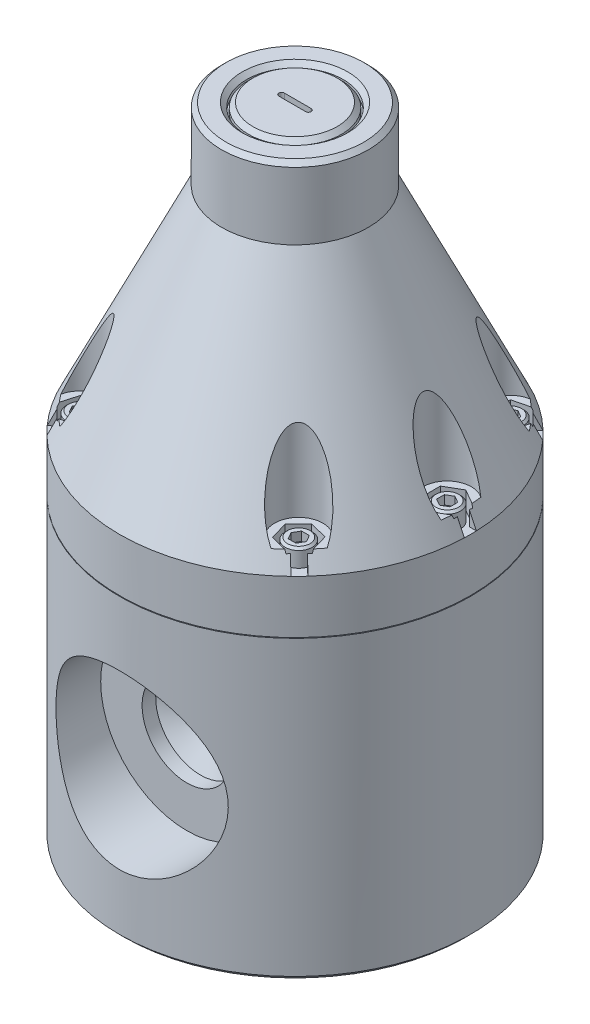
from build123d import *

# Parameters (mm, degrees)
SKETCH1_R                = 62.23
EXTRUDE1_DEPTH           = 226.06
SKETCH3_R                = 8.5725
EXTRUDE2_DEPTH           = 50.8
EXTRUDE3_DEPTH           = 6.223
SKETCH5_W                = 7.654715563
SKETCH5_H                = 4.2672
EXTRUDE4_DEPTH           = 6.223
SKETCH6_R                = 4.7625
EXTRUDE6_DEPTH           = 6.223
EXTRUDE7_DEPTH           = 3.175
CHAMFER1_SIZE            = 0.762
CHAMFER1_OF_MIRROR1_SIZE = 0.762
SKETCH8_R                = 17.145
EXTRUDE8_DEPTH           = 3.175
SKETCH9_R                = 16.51
EXTRUDE9_DEPTH           = 3.175
EXTRUDE10_DEPTH          = 3.175
CHAMFER2_SIZE            = 1.5748
CHAMFER3_SIZE            = 1.5748
CHAMFER4_SIZE            = 1.5748


with BuildPart() as part:
    # Sketch1 → Extrude1 (new body)
    with BuildSketch(Plane(origin=(0, 0, 0), x_dir=(1, 0, 0), z_dir=(0, 1, 0))):
        with Locations(Location((0, 0, 0), (0, 0, 90))):
            Circle(SKETCH1_R)
    extrude(amount=EXTRUDE1_DEPTH)

    # Sketch2 → Cut-Revolve1 (revolve, cut)
    with BuildSketch(Plane.XY, mode=Mode.PRIVATE) as cut_revolve1_sk:
        Polygon((-67.536130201, 105.41), (-45.085, 105.41), (-45.085, 105.664), (-62.23, 105.664), (-62.23, 124.46), (-26.035, 200.66), (-26.035, 228.6), (-77.461567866, 228.6), (-77.461567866, 105.41), align=None)
    revolve(cut_revolve1_sk.sketch.rotate(Axis((0, 0, 0), (0, 1, 0)), 180), axis=Axis((0, 0, 0), (0, 1, 0)), mode=Mode.SUBTRACT)

    # Sketch3 → Extrude2 (cut)
    with BuildSketch(Plane(origin=(0, 130.683, 0), x_dir=(-1, 0, 0), z_dir=(0, 1, 0))):
        with Locations((-38.826365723, 37.494185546)):
            Circle(SKETCH3_R)
        with Locations((-53.975, 0)):
            Circle(SKETCH3_R)
        with Locations((-38.826365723, -37.494185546)):
            Circle(SKETCH3_R)
    extrude2 = extrude(amount=EXTRUDE2_DEPTH, mode=Mode.SUBTRACT)

    # Sketch4 → Extrude3 (cut)
    with BuildSketch(Plane(origin=(0, 130.683, 0), x_dir=(-1, 0, 0), z_dir=(0, 1, 0))):
        Polygon((-43.410495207, 32.747180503), (-37.007403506, 31.150710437), (-32.423274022, 35.89771548), (-34.24223624, 42.241190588), (-40.64532794, 43.837660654), (-45.229457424, 39.090655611), align=None)
        Polygon((-53.975, 6.599113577), (-59.69, 3.299556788), (-59.69, -3.299556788), (-53.975, -6.599113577), (-48.26, -3.299556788), (-48.26, 3.299556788), align=None)
        Polygon((-43.410495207, -32.747180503), (-45.229457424, -39.090655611), (-40.64532794, -43.837660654), (-34.24223624, -42.241190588), (-32.423274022, -35.89771548), (-37.007403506, -31.150710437), align=None)
    extrude3 = extrude(amount=-EXTRUDE3_DEPTH, mode=Mode.SUBTRACT)

    # Sketch5 → Extrude4 (cut)
    with BuildSketch(Plane(origin=(0, 130.683, 0), x_dir=(-1, 0, 0), z_dir=(0, 1, 0))):
        Polygon((-39.947895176, 41.543286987), (-44.67273389, 46.106010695), (-47.49211039, 42.896544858), (-43.148780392, 38.702239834), align=None)
        with Locations((-60.345020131, 0)):
            Rectangle(SKETCH5_W, SKETCH5_H)
        Polygon((-41.449258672, -37.061030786), (-47.658063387, -43.056803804), (-44.752470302, -46.183011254), (-38.871838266, -40.504150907), align=None)
    extrude4 = extrude(amount=-EXTRUDE4_DEPTH, mode=Mode.SUBTRACT)

    # Sketch6 → Extrude6 (add)
    with BuildSketch(Plane(origin=(0, 130.683, 0), x_dir=(-1, 0, 0), z_dir=(0, 1, 0))):
        with Locations(Location((-38.826365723, 37.494185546, 0), (0, 0, 90))):
            Circle(SKETCH6_R)
        with Locations(Location((-53.975, 0, 0), (0, 0, 90))):
            Circle(SKETCH6_R)
        with Locations(Location((-38.826365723, -37.494185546, 0), (0, 0, 90))):
            Circle(SKETCH6_R)
    extrude6 = extrude(amount=-EXTRUDE6_DEPTH)

    # Sketch7 → Extrude7 (cut)
    with BuildSketch(Plane(origin=(0, 130.683, 0), x_dir=(-1, 0, 0), z_dir=(0, 1, 0))):
        Polygon((-41.568664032, 37.494185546), (-40.197514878, 35.119285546), (-37.455216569, 35.119285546), (-36.084067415, 37.494185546), (-37.455216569, 39.869085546), (-40.197514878, 39.869085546), align=None)
        Polygon((-53.975, 2.742298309), (-56.3499, 1.371149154), (-56.3499, -1.371149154), (-53.975, -2.742298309), (-51.6001, -1.371149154), (-51.6001, 1.371149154), align=None)
        Polygon((-38.826365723, -34.751887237), (-41.201265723, -36.123036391), (-41.201265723, -38.8653347), (-38.826365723, -40.236483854), (-36.451465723, -38.8653347), (-36.451465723, -36.123036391), align=None)
    extrude7 = extrude(amount=-EXTRUDE7_DEPTH, mode=Mode.SUBTRACT)

    # Chamfer1
    chamfer1_edges = [part.edges().sort_by_distance(p)[0] for p in [
        (38.826365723, 130.683, 32.731685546),
        (53.975, 130.683, -4.7625),
        (38.826365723, 130.683, -42.256685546),
    ]]
    chamfer(chamfer1_edges, length=CHAMFER1_SIZE)

    # Mirror1: Extrude2, Extrude3, Extrude4, Extrude6, Extrude7 across plane
    add(extrude2.mirror(Plane(origin=(0, 0, 0), x_dir=(0, 0, 1), z_dir=(1, 0, 0))), mode=Mode.SUBTRACT)
    add(extrude3.mirror(Plane(origin=(0, 0, 0), x_dir=(0, 0, 1), z_dir=(1, 0, 0))), mode=Mode.SUBTRACT)
    add(extrude4.mirror(Plane(origin=(0, 0, 0), x_dir=(0, 0, 1), z_dir=(1, 0, 0))), mode=Mode.SUBTRACT)
    add(extrude6.mirror(Plane(origin=(0, 0, 0), x_dir=(0, 0, 1), z_dir=(1, 0, 0))))
    add(extrude7.mirror(Plane(origin=(0, 0, 0), x_dir=(0, 0, 1), z_dir=(1, 0, 0))), mode=Mode.SUBTRACT)

    # Chamfer1 of Mirror1
    chamfer1_of_mirror1_edges = [part.edges().sort_by_distance(p)[0] for p in [
        (-38.826365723, 130.683, 32.731685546),
        (-53.975, 130.683, -4.7625),
        (-38.826365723, 130.683, -42.256685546),
    ]]
    chamfer(chamfer1_of_mirror1_edges, length=CHAMFER1_OF_MIRROR1_SIZE)

    # Sketch8 → Extrude8 (cut)
    with BuildSketch(Plane(origin=(0, 226.06, 0), x_dir=(-1, 0, 0), z_dir=(0, 1, 0))):
        with Locations(Location((0, 0, 0), (0, 0, 90))):
            Circle(SKETCH8_R)
    extrude(amount=-EXTRUDE8_DEPTH, mode=Mode.SUBTRACT)

    # Sketch9 → Extrude9 (add)
    with BuildSketch(Plane(origin=(0, 226.06, 0), x_dir=(-1, 0, 0), z_dir=(0, 1, 0))):
        with Locations(Location((0, 0, 0), (0, 0, 90))):
            Circle(SKETCH9_R)
    extrude(amount=-EXTRUDE9_DEPTH)

    # Sketch10 → Extrude10 (cut)
    with BuildSketch(Plane(origin=(0, 226.06, 0), x_dir=(-1, 0, 0), z_dir=(0, 1, 0))):
        with BuildLine():
            Line((-4.7625, 0.9652), (4.7625, 0.9652))
            ThreePointArc((4.7625, 0.9652), (5.7277, 0), (4.7625, -0.9652))
            Line((4.7625, -0.9652), (-4.7625, -0.9652))
            ThreePointArc((-4.7625, -0.9652), (-5.7277, 0), (-4.7625, 0.9652))
        make_face()
    extrude(amount=-EXTRUDE10_DEPTH, mode=Mode.SUBTRACT)

    # Chamfer2
    chamfer2_edges = [part.edges().sort_by_distance(p)[0] for p in [
        (0, 226.06, -17.145),
        (-26.035, 226.06, 0),
    ]]
    chamfer(chamfer2_edges, length=CHAMFER2_SIZE)

    # Chamfer3
    chamfer3_edges = [part.edges().sort_by_distance(p)[0] for p in [
        (0, 226.06, -16.51),
    ]]
    chamfer(chamfer3_edges, length=CHAMFER3_SIZE)

    # Chamfer4
    chamfer4_edges = [part.edges().sort_by_distance(p)[0] for p in [
        (0, 0, 62.23),
    ]]
    chamfer(chamfer4_edges, length=CHAMFER4_SIZE)

    # Sketch13 → CBORE for _00 Binding Head Machine Screw (revolve, cut)
    with BuildSketch(Plane(origin=(0, 52.07, 62.23), x_dir=(0, -1, 0), z_dir=(1, 0, 0))):
        Polygon((0, 0), (0, 36.616983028), (15.875, 28.702), (15.875, 23.876), (30.5562, 23.876), (30.5562, 0), align=None)
    cbore_for_00_binding_head_machine_screw = revolve(axis=Axis((0, 52.07, 68.58), (0, 0, -1)), mode=Mode.SUBTRACT)

    # Mirror2: CBORE for _00 Binding Head Machine Screw across plane
    add(cbore_for_00_binding_head_machine_screw.mirror(Plane.XY), mode=Mode.SUBTRACT)


solid = part.part
